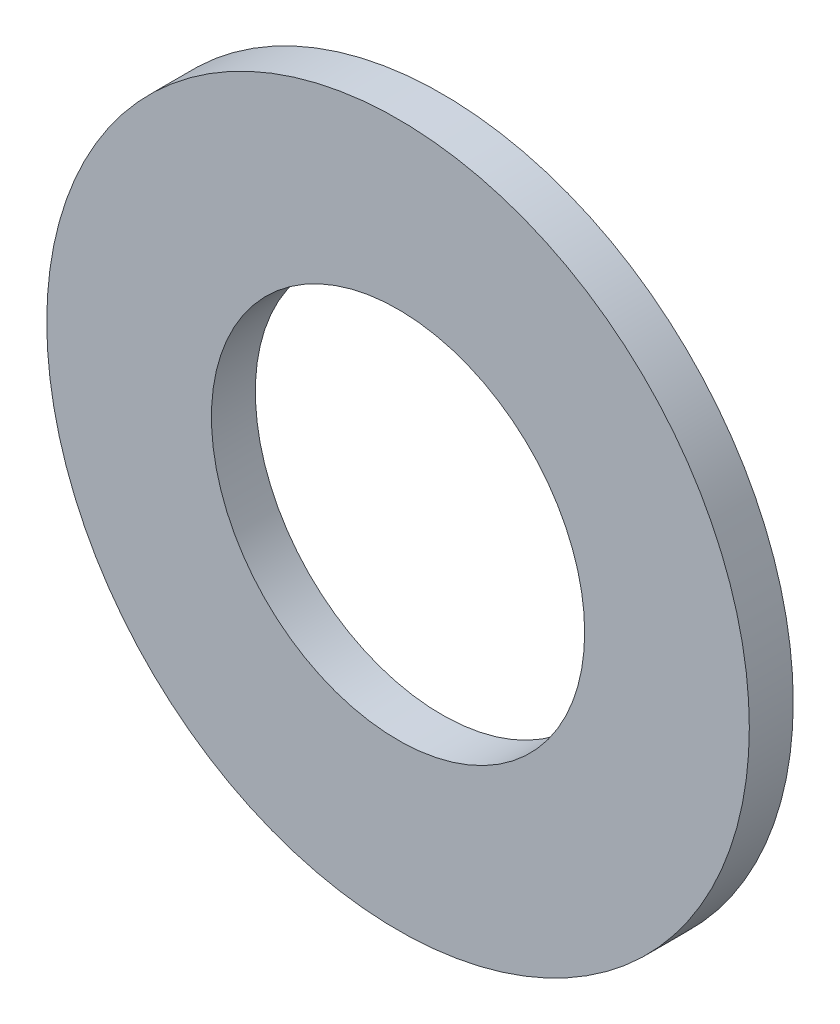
ISO-10303-21;
HEADER;
FILE_DESCRIPTION(('STEP AP214'),'2;1');
FILE_NAME('part.step','',(''),(''),'','','');
FILE_SCHEMA(('AUTOMOTIVE_DESIGN { 1 0 10303 214 1 1 1 1 }'));
ENDSEC;
DATA;
#1=APPLICATION_CONTEXT('core data for automotive mechanical design processes');
#2=APPLICATION_PROTOCOL_DEFINITION('international standard','automotive_design',2000,#1);
#3=PRODUCT_CONTEXT('',#1,'mechanical');
#4=PRODUCT('Part','Part','',(#3));
#5=PRODUCT_RELATED_PRODUCT_CATEGORY('part','',(#4));
#6=PRODUCT_DEFINITION_FORMATION('','',#4);
#7=PRODUCT_DEFINITION_CONTEXT('part definition',#1,'design');
#8=PRODUCT_DEFINITION('design','',#6,#7);
#9=PRODUCT_DEFINITION_SHAPE('','',#8);
#10=(LENGTH_UNIT() NAMED_UNIT(*) SI_UNIT(.MILLI.,.METRE.));
#11=(NAMED_UNIT(*) PLANE_ANGLE_UNIT() SI_UNIT($,.RADIAN.));
#12=(NAMED_UNIT(*) SI_UNIT($,.STERADIAN.) SOLID_ANGLE_UNIT());
#13=UNCERTAINTY_MEASURE_WITH_UNIT(LENGTH_MEASURE(1.E-05),#10,'distance_accuracy_value','');
#14=(GEOMETRIC_REPRESENTATION_CONTEXT(3) GLOBAL_UNCERTAINTY_ASSIGNED_CONTEXT((#13)) GLOBAL_UNIT_ASSIGNED_CONTEXT((#10,
#11,#12)) REPRESENTATION_CONTEXT('',''));
#15=CARTESIAN_POINT('',(0.,0.,0.));
#16=DIRECTION('',(0.,0.,1.));
#17=DIRECTION('',(1.,0.,0.));
#18=AXIS2_PLACEMENT_3D('',#15,#16,#17);
#19=CARTESIAN_POINT('',(0.,0.,3.175));
#20=DIRECTION('',(0.,0.,1.));
#21=DIRECTION('',(1.,0.,0.));
#22=AXIS2_PLACEMENT_3D('',#19,#20,#21);
#23=PLANE('',#22);
#24=CARTESIAN_POINT('',(0.,0.,3.175));
#25=DIRECTION('',(0.,0.,1.));
#26=DIRECTION('',(1.,0.,0.));
#27=AXIS2_PLACEMENT_3D('',#24,#25,#26);
#28=CIRCLE('',#27,50.8);
#29=CARTESIAN_POINT('',(50.8,0.,3.175));
#30=VERTEX_POINT('',#29);
#31=EDGE_CURVE('E10',#30,#30,#28,.T.);
#32=ORIENTED_EDGE('',*,*,#31,.T.);
#33=EDGE_LOOP('',(#32));
#34=FACE_BOUND('',#33,.T.);
#35=CARTESIAN_POINT('',(0.,0.,3.175));
#36=DIRECTION('',(0.,0.,1.));
#37=DIRECTION('',(1.,0.,0.));
#38=AXIS2_PLACEMENT_3D('',#35,#36,#37);
#39=CIRCLE('',#38,26.9875);
#40=CARTESIAN_POINT('',(26.9875,0.,3.175));
#41=VERTEX_POINT('',#40);
#42=EDGE_CURVE('E57',#41,#41,#39,.T.);
#43=ORIENTED_EDGE('',*,*,#42,.F.);
#44=EDGE_LOOP('',(#43));
#45=FACE_BOUND('',#44,.T.);
#46=ADVANCED_FACE('F43',(#34,#45),#23,.T.);
#47=CARTESIAN_POINT('',(0.,0.,-3.175));
#48=DIRECTION('',(0.,0.,1.));
#49=DIRECTION('',(1.,0.,0.));
#50=AXIS2_PLACEMENT_3D('',#47,#48,#49);
#51=PLANE('',#50);
#52=CARTESIAN_POINT('',(0.,0.,-3.175));
#53=DIRECTION('',(0.,0.,1.));
#54=DIRECTION('',(1.,0.,0.));
#55=AXIS2_PLACEMENT_3D('',#52,#53,#54);
#56=CIRCLE('',#55,50.8);
#57=CARTESIAN_POINT('',(50.8,0.,-3.175));
#58=VERTEX_POINT('',#57);
#59=EDGE_CURVE('E50',#58,#58,#56,.T.);
#60=ORIENTED_EDGE('',*,*,#59,.F.);
#61=EDGE_LOOP('',(#60));
#62=FACE_BOUND('',#61,.T.);
#63=CARTESIAN_POINT('',(0.,0.,-3.175));
#64=DIRECTION('',(0.,0.,1.));
#65=DIRECTION('',(1.,0.,0.));
#66=AXIS2_PLACEMENT_3D('',#63,#64,#65);
#67=CIRCLE('',#66,26.9875);
#68=CARTESIAN_POINT('',(26.9875,0.,-3.175));
#69=VERTEX_POINT('',#68);
#70=EDGE_CURVE('E59',#69,#69,#67,.T.);
#71=ORIENTED_EDGE('',*,*,#70,.T.);
#72=EDGE_LOOP('',(#71));
#73=FACE_BOUND('',#72,.T.);
#74=ADVANCED_FACE('F68',(#62,#73),#51,.F.);
#75=CARTESIAN_POINT('',(0.,0.,3.175));
#76=DIRECTION('',(0.,0.,-1.));
#77=DIRECTION('',(-1.,0.,0.));
#78=AXIS2_PLACEMENT_3D('',#75,#76,#77);
#79=CYLINDRICAL_SURFACE('',#78,50.8);
#80=ORIENTED_EDGE('',*,*,#31,.F.);
#81=EDGE_LOOP('',(#80));
#82=FACE_BOUND('',#81,.T.);
#83=ORIENTED_EDGE('',*,*,#59,.T.);
#84=EDGE_LOOP('',(#83));
#85=FACE_BOUND('',#84,.T.);
#86=ADVANCED_FACE('F44',(#82,#85),#79,.T.);
#87=CARTESIAN_POINT('',(0.,0.,3.175));
#88=DIRECTION('',(0.,0.,-1.));
#89=DIRECTION('',(-1.,0.,0.));
#90=AXIS2_PLACEMENT_3D('',#87,#88,#89);
#91=CYLINDRICAL_SURFACE('',#90,26.9875);
#92=ORIENTED_EDGE('',*,*,#42,.T.);
#93=EDGE_LOOP('',(#92));
#94=FACE_BOUND('',#93,.T.);
#95=ORIENTED_EDGE('',*,*,#70,.F.);
#96=EDGE_LOOP('',(#95));
#97=FACE_BOUND('',#96,.T.);
#98=ADVANCED_FACE('F67',(#94,#97),#91,.F.);
#99=CLOSED_SHELL('',(#46,#74,#86,#98));
#100=MANIFOLD_SOLID_BREP('B2',#99);
#101=ADVANCED_BREP_SHAPE_REPRESENTATION('',(#18,#100),#14);
#102=SHAPE_DEFINITION_REPRESENTATION(#9,#101);
ENDSEC;
END-ISO-10303-21;
